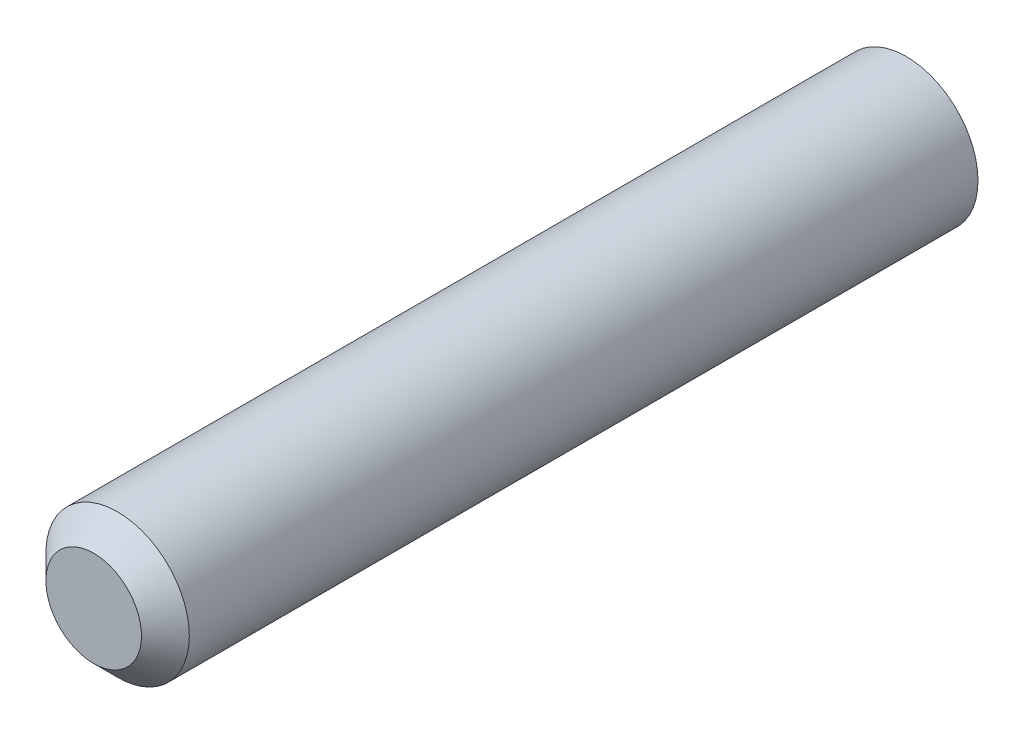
ISO-10303-21;
HEADER;
FILE_DESCRIPTION(('STEP AP214'),'2;1');
FILE_NAME('part.step','',(''),(''),'','','');
FILE_SCHEMA(('AUTOMOTIVE_DESIGN { 1 0 10303 214 1 1 1 1 }'));
ENDSEC;
DATA;
#1=APPLICATION_CONTEXT('core data for automotive mechanical design processes');
#2=APPLICATION_PROTOCOL_DEFINITION('international standard','automotive_design',2000,#1);
#3=PRODUCT_CONTEXT('',#1,'mechanical');
#4=PRODUCT('Part','Part','',(#3));
#5=PRODUCT_RELATED_PRODUCT_CATEGORY('part','',(#4));
#6=PRODUCT_DEFINITION_FORMATION('','',#4);
#7=PRODUCT_DEFINITION_CONTEXT('part definition',#1,'design');
#8=PRODUCT_DEFINITION('design','',#6,#7);
#9=PRODUCT_DEFINITION_SHAPE('','',#8);
#10=(LENGTH_UNIT() NAMED_UNIT(*) SI_UNIT(.MILLI.,.METRE.));
#11=(NAMED_UNIT(*) PLANE_ANGLE_UNIT() SI_UNIT($,.RADIAN.));
#12=(NAMED_UNIT(*) SI_UNIT($,.STERADIAN.) SOLID_ANGLE_UNIT());
#13=UNCERTAINTY_MEASURE_WITH_UNIT(LENGTH_MEASURE(1.E-05),#10,'distance_accuracy_value','');
#14=(GEOMETRIC_REPRESENTATION_CONTEXT(3) GLOBAL_UNCERTAINTY_ASSIGNED_CONTEXT((#13)) GLOBAL_UNIT_ASSIGNED_CONTEXT((#10,
#11,#12)) REPRESENTATION_CONTEXT('',''));
#15=CARTESIAN_POINT('',(0.,0.,0.));
#16=DIRECTION('',(0.,0.,1.));
#17=DIRECTION('',(1.,0.,0.));
#18=AXIS2_PLACEMENT_3D('',#15,#16,#17);
#19=CARTESIAN_POINT('',(0.,0.,8.50000000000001));
#20=DIRECTION('',(0.,0.,-1.));
#21=DIRECTION('',(-0.999999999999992,0.,0.));
#22=AXIS2_PLACEMENT_3D('',#19,#20,#21);
#23=CYLINDRICAL_SURFACE('',#22,1.5);
#24=CARTESIAN_POINT('',(0.,0.,7.99999999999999));
#25=DIRECTION('',(0.,0.,1.));
#26=DIRECTION('',(0.999999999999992,0.,0.));
#27=AXIS2_PLACEMENT_3D('',#24,#25,#26);
#28=CIRCLE('',#27,1.5);
#29=CARTESIAN_POINT('',(1.49999999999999,0.,7.99999999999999));
#30=VERTEX_POINT('',#29);
#31=EDGE_CURVE('E10',#30,#30,#28,.F.);
#32=ORIENTED_EDGE('',*,*,#31,.T.);
#33=EDGE_LOOP('',(#32));
#34=FACE_BOUND('',#33,.T.);
#35=CARTESIAN_POINT('',(0.,0.,-8.50000000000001));
#36=DIRECTION('',(0.,0.,1.));
#37=DIRECTION('',(0.999999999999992,0.,0.));
#38=AXIS2_PLACEMENT_3D('',#35,#36,#37);
#39=CIRCLE('',#38,1.5);
#40=CARTESIAN_POINT('',(1.5,0.,-8.50000000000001));
#41=VERTEX_POINT('',#40);
#42=EDGE_CURVE('E46',#41,#41,#39,.T.);
#43=ORIENTED_EDGE('',*,*,#42,.T.);
#44=EDGE_LOOP('',(#43));
#45=FACE_BOUND('',#44,.T.);
#46=ADVANCED_FACE('F35',(#34,#45),#23,.T.);
#47=CARTESIAN_POINT('',(0.,0.,8.50000000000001));
#48=DIRECTION('',(0.,0.,1.));
#49=DIRECTION('',(0.999999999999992,0.,0.));
#50=AXIS2_PLACEMENT_3D('',#47,#48,#49);
#51=PLANE('',#50);
#52=CARTESIAN_POINT('',(0.,0.,8.50000000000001));
#53=DIRECTION('',(0.,0.,1.));
#54=DIRECTION('',(0.999999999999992,0.,0.));
#55=AXIS2_PLACEMENT_3D('',#52,#53,#54);
#56=CIRCLE('',#55,0.999999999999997);
#57=CARTESIAN_POINT('',(0.99999999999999,0.,8.50000000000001));
#58=VERTEX_POINT('',#57);
#59=EDGE_CURVE('E42',#58,#58,#56,.T.);
#60=ORIENTED_EDGE('',*,*,#59,.T.);
#61=EDGE_LOOP('',(#60));
#62=FACE_BOUND('',#61,.T.);
#63=ADVANCED_FACE('F56',(#62),#51,.T.);
#64=CARTESIAN_POINT('',(0.,0.,-8.50000000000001));
#65=DIRECTION('',(0.,0.,1.));
#66=DIRECTION('',(0.999999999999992,0.,0.));
#67=AXIS2_PLACEMENT_3D('',#64,#65,#66);
#68=PLANE('',#67);
#69=ORIENTED_EDGE('',*,*,#42,.F.);
#70=EDGE_LOOP('',(#69));
#71=FACE_BOUND('',#70,.T.);
#72=ADVANCED_FACE('F54',(#71),#68,.F.);
#73=CARTESIAN_POINT('',(0.,0.,8.50000000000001));
#74=DIRECTION('',(0.,0.,-1.));
#75=DIRECTION('',(-0.999999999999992,0.,0.));
#76=AXIS2_PLACEMENT_3D('',#73,#74,#75);
#77=CONICAL_SURFACE('',#76,0.999999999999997,0.785398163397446);
#78=ORIENTED_EDGE('',*,*,#31,.F.);
#79=EDGE_LOOP('',(#78));
#80=FACE_BOUND('',#79,.T.);
#81=ORIENTED_EDGE('',*,*,#59,.F.);
#82=EDGE_LOOP('',(#81));
#83=FACE_BOUND('',#82,.T.);
#84=ADVANCED_FACE('F37',(#80,#83),#77,.T.);
#85=CLOSED_SHELL('',(#46,#63,#72,#84));
#86=MANIFOLD_SOLID_BREP('B2',#85);
#87=ADVANCED_BREP_SHAPE_REPRESENTATION('',(#18,#86),#14);
#88=SHAPE_DEFINITION_REPRESENTATION(#9,#87);
ENDSEC;
END-ISO-10303-21;
